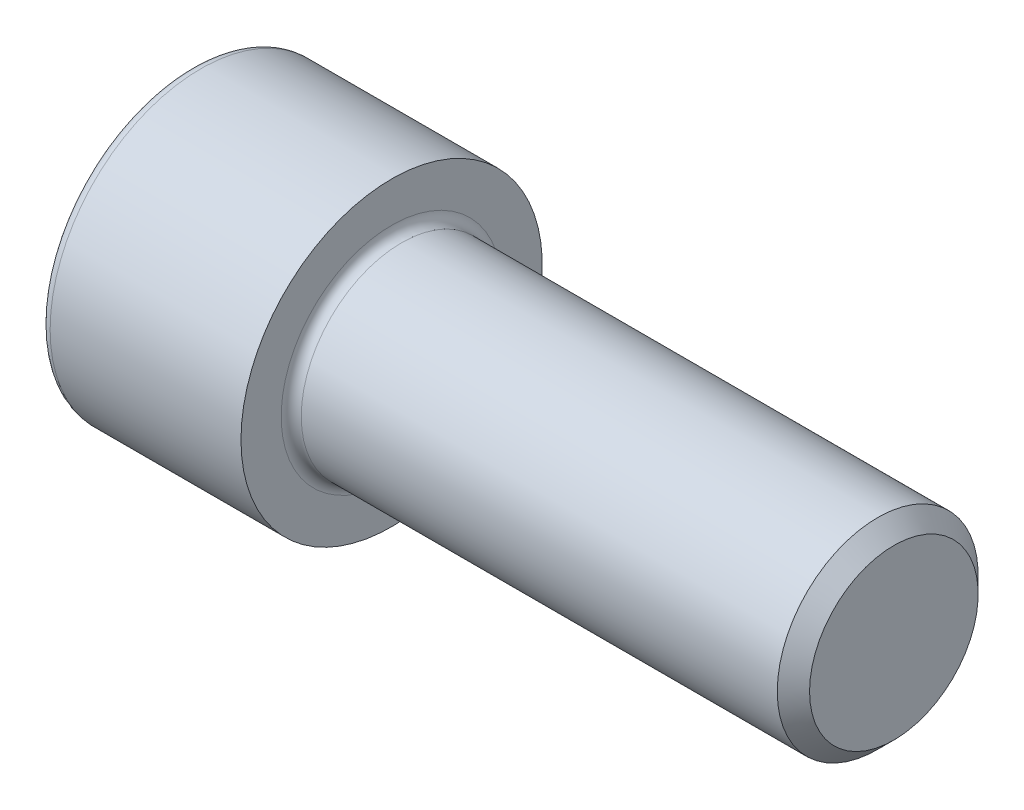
from build123d import *

# Parameters (mm, degrees)
FILLET1_R   = 0.6
FILLET2_R   = 0.6
HEX_2_DEPTH = 6


with BuildPart() as part:
    # BodySke → Base-Revolve (revolve)
    with BuildSketch(Plane.XY, mode=Mode.PRIVATE) as base_revolve_sk:
        Polygon((0, 0), (0, 9), (12, 9), (12, 6), (41.036, 6), (42, 5.036), (42, 0), align=None)
    revolve(base_revolve_sk.sketch.rotate(Axis((-31.75, 0, 0), (1, 0, 0)), 90), axis=Axis((-31.75, 0, 0), (1, 0, 0)))

    # Fillet1
    fillet1_edges = [part.edges().sort_by_distance(p)[0] for p in [
        (12, 0, -6),
    ]]
    fillet(fillet1_edges, radius=FILLET1_R)

    # Fillet2
    fillet2_edges = [part.edges().sort_by_distance(p)[0] for p in [
        (0, 0, -9),
    ]]
    fillet(fillet2_edges, radius=FILLET2_R)

    # Sketch2 → Hex-PreBroach (revolve, cut)
    with BuildSketch(Plane.XY, mode=Mode.PRIVATE) as hex_prebroach_sk:
        Polygon((0, 5.0575), (6, 5.0575), (8.919948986, 0), (0, 0), align=None)
    revolve(hex_prebroach_sk.sketch.rotate(Axis((0, 0, 0), (1, 0, 0)), 90), axis=Axis((0, 0, 0), (1, 0, 0)), mode=Mode.SUBTRACT)

    # Sketch3 → Hex 2 (cut)
    with BuildSketch(Plane(origin=(0, 0, 0), x_dir=(0, 0.500000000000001, 0.866025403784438), z_dir=(-1, 0, 0))):
        Polygon((2.919948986, 5.0575), (-2.919948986, 5.0575), (-5.839897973, 0), (-2.919948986, -5.0575), (2.919948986, -5.0575), (5.839897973, 0), align=None)
    extrude(amount=-HEX_2_DEPTH, mode=Mode.SUBTRACT)


solid = part.part
